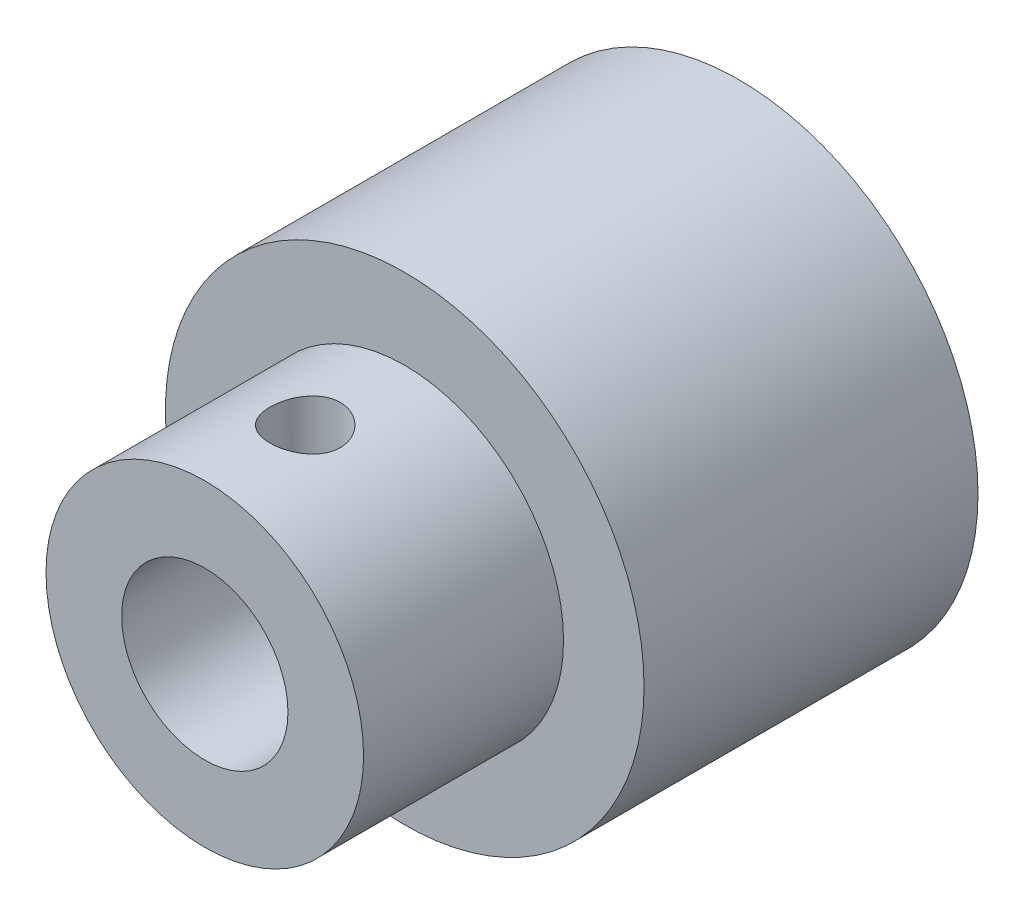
from build123d import *

# Parameters (mm, degrees)
SKETCH1_R                  = 14.2875
EXTRUDE1_DEPTH             = 19.939
SKETCH2_R                  = 9.48055
EXTRUDE2_DEPTH             = 11.938
F_10_0_10_DIAMETER_HOLE1_D = 9.9314
M5X0_8_TAPPED_HOLE1_REACH  = 39.934
M5X0_8_TAPPED_HOLE1_BORE_R = 2.1


with BuildPart() as part:
    # Sketch1 → Extrude1 (new body)
    with BuildSketch(Plane.XY):
        Circle(SKETCH1_R)
    extrude(amount=-EXTRUDE1_DEPTH)

    # Sketch2 → Extrude2 (add)
    with BuildSketch(Plane.XY):
        Circle(SKETCH2_R)
    extrude(amount=EXTRUDE2_DEPTH)

    # 10.0 _10_ Diameter Hole1 (through all)
    with Locations(Plane.XY.offset(11.938)):
        with Locations((0, 0)):
            Hole(F_10_0_10_DIAMETER_HOLE1_D / 2)

    # M5x0.8 Tapped Hole1 bore (on position points) → M5x0.8 Tapped Hole1 (cut, up to next)
    with BuildSketch(Plane(origin=(0, 9.48055, 5.9436), x_dir=(1, 0, 0), z_dir=(0, 1, 0)), mode=Mode.PRIVATE) as m5x0_8_tapped_hole1_sk1:
        Circle(M5X0_8_TAPPED_HOLE1_BORE_R)
    m5x0_8_tapped_hole1_tool1 = extrude(m5x0_8_tapped_hole1_sk1.sketch, amount=-M5X0_8_TAPPED_HOLE1_REACH, mode=Mode.PRIVATE) & part.part
    add(m5x0_8_tapped_hole1_tool1.solids().sort_by_distance((0, 9.48055, 5.9436))[0], mode=Mode.SUBTRACT)


solid = part.part
